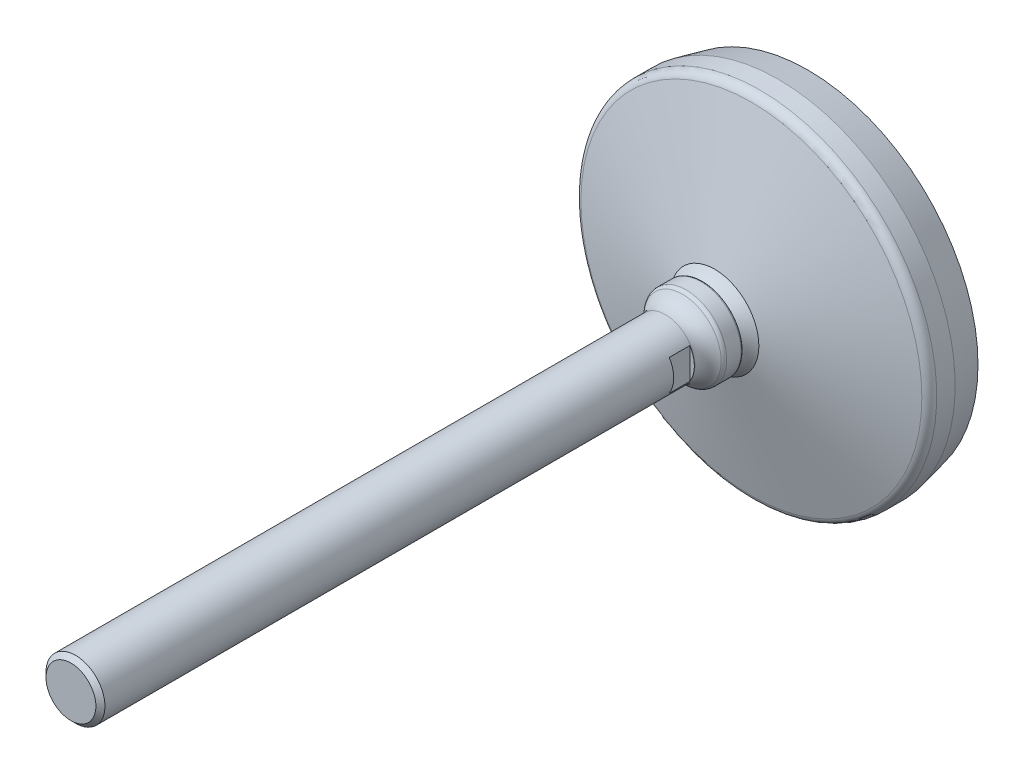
ISO-10303-21;
HEADER;
FILE_DESCRIPTION(('STEP AP214'),'2;1');
FILE_NAME('part.step','',(''),(''),'','','');
FILE_SCHEMA(('AUTOMOTIVE_DESIGN { 1 0 10303 214 1 1 1 1 }'));
ENDSEC;
DATA;
#1=APPLICATION_CONTEXT('core data for automotive mechanical design processes');
#2=APPLICATION_PROTOCOL_DEFINITION('international standard','automotive_design',2000,#1);
#3=PRODUCT_CONTEXT('',#1,'mechanical');
#4=PRODUCT('Part','Part','',(#3));
#5=PRODUCT_RELATED_PRODUCT_CATEGORY('part','',(#4));
#6=PRODUCT_DEFINITION_FORMATION('','',#4);
#7=PRODUCT_DEFINITION_CONTEXT('part definition',#1,'design');
#8=PRODUCT_DEFINITION('design','',#6,#7);
#9=PRODUCT_DEFINITION_SHAPE('','',#8);
#10=(LENGTH_UNIT() NAMED_UNIT(*) SI_UNIT(.MILLI.,.METRE.));
#11=(NAMED_UNIT(*) PLANE_ANGLE_UNIT() SI_UNIT($,.RADIAN.));
#12=(NAMED_UNIT(*) SI_UNIT($,.STERADIAN.) SOLID_ANGLE_UNIT());
#13=UNCERTAINTY_MEASURE_WITH_UNIT(LENGTH_MEASURE(1.E-05),#10,'distance_accuracy_value','');
#14=(GEOMETRIC_REPRESENTATION_CONTEXT(3) GLOBAL_UNCERTAINTY_ASSIGNED_CONTEXT((#13)) GLOBAL_UNIT_ASSIGNED_CONTEXT((#10,
#11,#12)) REPRESENTATION_CONTEXT('',''));
#15=CARTESIAN_POINT('',(0.,0.,0.));
#16=DIRECTION('',(0.,0.,1.));
#17=DIRECTION('',(1.,0.,0.));
#18=AXIS2_PLACEMENT_3D('',#15,#16,#17);
#19=CARTESIAN_POINT('',(0.,0.,40.6420167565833));
#20=DIRECTION('',(0.,0.,-1.));
#21=DIRECTION('',(0.,1.,0.));
#22=AXIS2_PLACEMENT_3D('',#19,#20,#21);
#23=TOROIDAL_SURFACE('',#22,22.8893556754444,12.);
#24=CARTESIAN_POINT('',(0.,0.,31.6));
#25=DIRECTION('',(0.,0.,-1.));
#26=DIRECTION('',(0.,1.,0.));
#27=AXIS2_PLACEMENT_3D('',#24,#25,#26);
#28=CIRCLE('',#27,15.);
#29=CARTESIAN_POINT('',(0.,15.,31.6));
#30=VERTEX_POINT('',#29);
#31=EDGE_CURVE('E86',#30,#30,#28,.T.);
#32=ORIENTED_EDGE('',*,*,#31,.F.);
#33=EDGE_LOOP('',(#32));
#34=FACE_BOUND('',#33,.T.);
#35=CARTESIAN_POINT('',(0.,0.,35.6));
#36=DIRECTION('',(0.,0.,-1.));
#37=DIRECTION('',(0.,1.,0.));
#38=AXIS2_PLACEMENT_3D('',#35,#36,#37);
#39=CIRCLE('',#38,12.);
#40=CARTESIAN_POINT('',(0.,12.,35.6));
#41=VERTEX_POINT('',#40);
#42=EDGE_CURVE('E61',#41,#41,#39,.T.);
#43=ORIENTED_EDGE('',*,*,#42,.T.);
#44=EDGE_LOOP('',(#43));
#45=FACE_BOUND('',#44,.T.);
#46=ADVANCED_FACE('F14',(#34,#45),#23,.F.);
#47=CARTESIAN_POINT('',(0.,0.,31.6));
#48=DIRECTION('',(0.,0.,-1.));
#49=DIRECTION('',(0.,1.,0.));
#50=AXIS2_PLACEMENT_3D('',#47,#48,#49);
#51=CONICAL_SURFACE('',#50,15.,1.2875142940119);
#52=CARTESIAN_POINT('',(0.,0.,19.1292293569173));
#53=DIRECTION('',(0.,0.,-1.));
#54=DIRECTION('',(0.,1.,0.));
#55=AXIS2_PLACEMENT_3D('',#52,#53,#54);
#56=CIRCLE('',#55,57.8385251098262);
#57=CARTESIAN_POINT('',(0.,57.8385251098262,19.1292293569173));
#58=VERTEX_POINT('',#57);
#59=EDGE_CURVE('E89',#58,#58,#56,.T.);
#60=CARTESIAN_POINT('',(0.,57.8385251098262,19.1292293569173));
#61=CARTESIAN_POINT('',(0.,57.3922904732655,19.2591332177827));
#62=CARTESIAN_POINT('',(0.,56.9460558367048,19.3890370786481));
#63=CARTESIAN_POINT('',(0.,56.0535865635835,19.648844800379));
#64=CARTESIAN_POINT('',(0.,55.6073519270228,19.7787486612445));
#65=CARTESIAN_POINT('',(0.,54.7148826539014,20.0385563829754));
#66=CARTESIAN_POINT('',(0.,54.2686480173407,20.1684602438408));
#67=CARTESIAN_POINT('',(0.,53.3761787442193,20.4282679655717));
#68=CARTESIAN_POINT('',(0.,52.9299441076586,20.5581718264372));
#69=CARTESIAN_POINT('',(0.,52.0374748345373,20.817979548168));
#70=CARTESIAN_POINT('',(0.,51.5912401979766,20.9478834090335));
#71=CARTESIAN_POINT('',(0.,50.6987709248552,21.2076911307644));
#72=CARTESIAN_POINT('',(0.,50.2525362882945,21.3375949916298));
#73=CARTESIAN_POINT('',(0.,49.3600670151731,21.5974027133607));
#74=CARTESIAN_POINT('',(0.,48.9138323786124,21.7273065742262));
#75=CARTESIAN_POINT('',(0.,48.021363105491,21.9871142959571));
#76=CARTESIAN_POINT('',(0.,47.5751284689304,22.1170181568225));
#77=CARTESIAN_POINT('',(0.,46.682659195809,22.3768258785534));
#78=CARTESIAN_POINT('',(0.,46.2364245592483,22.5067297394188));
#79=CARTESIAN_POINT('',(0.,45.3439552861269,22.7665374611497));
#80=CARTESIAN_POINT('',(0.,44.8977206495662,22.8964413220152));
#81=CARTESIAN_POINT('',(0.,44.0052513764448,23.1562490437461));
#82=CARTESIAN_POINT('',(0.,43.5590167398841,23.2861529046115));
#83=CARTESIAN_POINT('',(0.,42.6665474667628,23.5459606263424));
#84=CARTESIAN_POINT('',(0.,42.2203128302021,23.6758644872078));
#85=CARTESIAN_POINT('',(0.,41.3278435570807,23.9356722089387));
#86=CARTESIAN_POINT('',(0.,40.88160892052,24.0655760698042));
#87=CARTESIAN_POINT('',(0.,39.9891396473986,24.3253837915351));
#88=CARTESIAN_POINT('',(0.,39.5429050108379,24.4552876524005));
#89=CARTESIAN_POINT('',(0.,38.6504357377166,24.7150953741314));
#90=CARTESIAN_POINT('',(0.,38.2042011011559,24.8449992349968));
#91=CARTESIAN_POINT('',(0.,37.3117318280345,25.1048069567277));
#92=CARTESIAN_POINT('',(0.,36.8654971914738,25.2347108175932));
#93=CARTESIAN_POINT('',(0.,35.9730279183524,25.4945185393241));
#94=CARTESIAN_POINT('',(0.,35.5267932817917,25.6244224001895));
#95=CARTESIAN_POINT('',(0.,34.6343240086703,25.8842301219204));
#96=CARTESIAN_POINT('',(0.,34.1880893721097,26.0141339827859));
#97=CARTESIAN_POINT('',(0.,33.2956200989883,26.2739417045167));
#98=CARTESIAN_POINT('',(0.,32.8493854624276,26.4038455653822));
#99=CARTESIAN_POINT('',(0.,31.9569161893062,26.6636532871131));
#100=CARTESIAN_POINT('',(0.,31.5106815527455,26.7935571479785));
#101=CARTESIAN_POINT('',(0.,30.6182122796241,27.0533648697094));
#102=CARTESIAN_POINT('',(0.,30.1719776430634,27.1832687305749));
#103=CARTESIAN_POINT('',(0.,29.2795083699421,27.4430764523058));
#104=CARTESIAN_POINT('',(0.,28.8332737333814,27.5729803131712));
#105=CARTESIAN_POINT('',(0.,27.94080446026,27.8327880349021));
#106=CARTESIAN_POINT('',(0.,27.4945698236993,27.9626918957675));
#107=CARTESIAN_POINT('',(0.,26.6021005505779,28.2224996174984));
#108=CARTESIAN_POINT('',(0.,26.1558659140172,28.3524034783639));
#109=CARTESIAN_POINT('',(0.,25.2633966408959,28.6122112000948));
#110=CARTESIAN_POINT('',(0.,24.8171620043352,28.7421150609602));
#111=CARTESIAN_POINT('',(0.,23.9246927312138,29.0019227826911));
#112=CARTESIAN_POINT('',(0.,23.4784580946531,29.1318266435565));
#113=CARTESIAN_POINT('',(0.,22.5859888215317,29.3916343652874));
#114=CARTESIAN_POINT('',(0.,22.139754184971,29.5215382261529));
#115=CARTESIAN_POINT('',(0.,21.2472849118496,29.7813459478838));
#116=CARTESIAN_POINT('',(0.,20.801050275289,29.9112498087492));
#117=CARTESIAN_POINT('',(0.,19.9085810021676,30.1710575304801));
#118=CARTESIAN_POINT('',(0.,19.4623463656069,30.3009613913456));
#119=CARTESIAN_POINT('',(0.,18.5698770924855,30.5607691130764));
#120=CARTESIAN_POINT('',(0.,18.1236424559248,30.6906729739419));
#121=CARTESIAN_POINT('',(0.,17.2311731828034,30.9504806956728));
#122=CARTESIAN_POINT('',(0.,16.7849385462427,31.0803845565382));
#123=CARTESIAN_POINT('',(0.,15.8924692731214,31.3401922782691));
#124=CARTESIAN_POINT('',(0.,15.4462346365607,31.4700961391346));
#125=CARTESIAN_POINT('',(0.,15.,31.6));
#126=B_SPLINE_CURVE_WITH_KNOTS('',3,(#60,#61,#62,#63,#64,#65,#66,#67,#68,#69,#70,#71,#72,#73,
#74,#75,#76,#77,#78,#79,#80,#81,#82,#83,#84,#85,#86,#87,#88,#89,#90,#91,#92,#93,#94,#95,#96,#97,
#98,#99,#100,#101,#102,#103,#104,#105,#106,#107,#108,#109,#110,#111,#112,#113,#114,#115,#116,
#117,#118,#119,#120,#121,#122,#123,#124,#125),.UNSPECIFIED.,.F.,.F.,(4,2,2,2,2,2,2,2,2,2,2,2,2,
2,2,2,2,2,2,2,2,2,2,2,2,2,2,2,2,2,2,2,4),(0.,1.39427517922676,2.78855035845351,4.18282553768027,
5.57710071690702,6.97137589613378,8.36565107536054,9.75992625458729,11.154201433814,
12.5484766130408,13.9427517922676,15.3370269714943,16.7313021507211,18.1255773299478,
19.5198525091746,20.9141276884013,22.3084028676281,23.7026780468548,25.0969532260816,
26.4912284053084,27.8855035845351,29.2797787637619,30.6740539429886,32.0683291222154,
33.4626043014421,34.8568794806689,36.2511546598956,37.6454298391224,39.0397050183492,
40.4339801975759,41.8282553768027,43.2225305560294,44.6168057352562),.UNSPECIFIED.);
#127=EDGE_CURVE('BSEAM147',#58,#30,#126,.T.);
#128=ORIENTED_EDGE('',*,*,#59,.F.);
#129=ORIENTED_EDGE('',*,*,#31,.T.);
#130=ORIENTED_EDGE('',*,*,#127,.T.);
#131=ORIENTED_EDGE('',*,*,#127,.F.);
#132=EDGE_LOOP('',(#128,#130,#129,#131));
#133=FACE_BOUND('',#132,.T.);
#134=ADVANCED_FACE('F147',(#133),#51,.T.);
#135=CARTESIAN_POINT('',(0.,0.,16.2487995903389));
#136=DIRECTION('',(0.,0.,-1.));
#137=DIRECTION('',(0.,1.,0.));
#138=AXIS2_PLACEMENT_3D('',#135,#136,#137);
#139=TOROIDAL_SURFACE('',#138,57.,2.99999999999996);
#140=ORIENTED_EDGE('',*,*,#59,.T.);
#141=EDGE_LOOP('',(#140));
#142=FACE_BOUND('',#141,.T.);
#143=CARTESIAN_POINT('',(0.,0.,16.2487995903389));
#144=DIRECTION('',(0.,0.,-1.));
#145=DIRECTION('',(0.,1.,0.));
#146=AXIS2_PLACEMENT_3D('',#143,#144,#145);
#147=CIRCLE('',#146,60.);
#148=CARTESIAN_POINT('',(0.,60.,16.2487995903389));
#149=VERTEX_POINT('',#148);
#150=EDGE_CURVE('E92',#149,#149,#147,.T.);
#151=ORIENTED_EDGE('',*,*,#150,.F.);
#152=EDGE_LOOP('',(#151));
#153=FACE_BOUND('',#152,.T.);
#154=ADVANCED_FACE('F153',(#142,#153),#139,.T.);
#155=CARTESIAN_POINT('',(0.,0.,0.));
#156=DIRECTION('',(0.,0.,-1.));
#157=DIRECTION('',(0.,1.,0.));
#158=AXIS2_PLACEMENT_3D('',#155,#156,#157);
#159=CYLINDRICAL_SURFACE('',#158,60.);
#160=CARTESIAN_POINT('',(0.,0.,10.));
#161=DIRECTION('',(0.,0.,-1.));
#162=DIRECTION('',(0.,1.,0.));
#163=AXIS2_PLACEMENT_3D('',#160,#161,#162);
#164=CIRCLE('',#163,60.);
#165=CARTESIAN_POINT('',(0.,60.,10.));
#166=VERTEX_POINT('',#165);
#167=EDGE_CURVE('E95',#166,#166,#164,.T.);
#168=ORIENTED_EDGE('',*,*,#167,.F.);
#169=EDGE_LOOP('',(#168));
#170=FACE_BOUND('',#169,.T.);
#171=ORIENTED_EDGE('',*,*,#150,.T.);
#172=EDGE_LOOP('',(#171));
#173=FACE_BOUND('',#172,.T.);
#174=ADVANCED_FACE('F198',(#170,#173),#159,.T.);
#175=CARTESIAN_POINT('',(0.,0.,10.));
#176=DIRECTION('',(0.,0.,1.));
#177=DIRECTION('',(0.,-1.,0.));
#178=AXIS2_PLACEMENT_3D('',#175,#176,#177);
#179=CONICAL_SURFACE('',#178,60.,0.221314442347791);
#180=CARTESIAN_POINT('',(0.,0.,0.));
#181=DIRECTION('',(0.,0.,-1.));
#182=DIRECTION('',(0.,1.,0.));
#183=AXIS2_PLACEMENT_3D('',#180,#181,#182);
#184=CIRCLE('',#183,57.75);
#185=CARTESIAN_POINT('',(0.,57.75,0.));
#186=VERTEX_POINT('',#185);
#187=EDGE_CURVE('E98',#186,#186,#184,.T.);
#188=ORIENTED_EDGE('',*,*,#187,.F.);
#189=EDGE_LOOP('',(#188));
#190=FACE_BOUND('',#189,.T.);
#191=ORIENTED_EDGE('',*,*,#167,.T.);
#192=EDGE_LOOP('',(#191));
#193=FACE_BOUND('',#192,.T.);
#194=ADVANCED_FACE('F194',(#190,#193),#179,.T.);
#195=CARTESIAN_POINT('',(57.75,0.,0.));
#196=DIRECTION('',(0.,0.,1.));
#197=DIRECTION('',(0.,-1.,0.));
#198=AXIS2_PLACEMENT_3D('',#195,#196,#197);
#199=PLANE('',#198);
#200=ORIENTED_EDGE('',*,*,#187,.T.);
#201=EDGE_LOOP('',(#200));
#202=FACE_BOUND('',#201,.T.);
#203=ADVANCED_FACE('F187',(#202),#199,.F.);
#204=CARTESIAN_POINT('',(0.,0.,16.));
#205=DIRECTION('',(0.,0.,-1.));
#206=DIRECTION('',(0.,1.,0.));
#207=AXIS2_PLACEMENT_3D('',#204,#205,#206);
#208=CYLINDRICAL_SURFACE('',#207,10.);
#209=CARTESIAN_POINT('',(0.,0.,48.3));
#210=DIRECTION('',(0.,0.,-1.));
#211=DIRECTION('',(0.,1.,0.));
#212=AXIS2_PLACEMENT_3D('',#209,#210,#211);
#213=CIRCLE('',#212,10.);
#214=CARTESIAN_POINT('',(0.,10.,48.3));
#215=VERTEX_POINT('',#214);
#216=EDGE_CURVE('E107',#215,#215,#213,.T.);
#217=ORIENTED_EDGE('',*,*,#216,.F.);
#218=EDGE_LOOP('',(#217));
#219=FACE_BOUND('',#218,.T.);
#220=DIRECTION('',(0.,0.,-1.));
#221=VECTOR('',#220,1.);
#222=CARTESIAN_POINT('',(8.5,-5.26782687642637,16.));
#223=LINE('',#222,#221);
#224=CARTESIAN_POINT('',(8.5,-5.26782687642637,48.5));
#225=VERTEX_POINT('',#224);
#226=CARTESIAN_POINT('',(8.5,-5.26782687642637,55.5));
#227=VERTEX_POINT('',#226);
#228=EDGE_CURVE('E77',#225,#227,#223,.F.);
#229=ORIENTED_EDGE('',*,*,#228,.T.);
#230=CARTESIAN_POINT('',(0.,0.,55.5));
#231=DIRECTION('',(0.,0.,1.));
#232=DIRECTION('',(0.,-1.,0.));
#233=AXIS2_PLACEMENT_3D('',#230,#231,#232);
#234=CIRCLE('',#233,10.);
#235=CARTESIAN_POINT('',(8.5,5.26782687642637,55.5));
#236=VERTEX_POINT('',#235);
#237=EDGE_CURVE('E9',#227,#236,#234,.T.);
#238=ORIENTED_EDGE('',*,*,#237,.T.);
#239=DIRECTION('',(0.,0.,-1.));
#240=VECTOR('',#239,1.);
#241=CARTESIAN_POINT('',(8.5,5.26782687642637,16.));
#242=LINE('',#241,#240);
#243=CARTESIAN_POINT('',(8.5,5.26782687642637,48.5));
#244=VERTEX_POINT('',#243);
#245=EDGE_CURVE('E17',#236,#244,#242,.T.);
#246=ORIENTED_EDGE('',*,*,#245,.T.);
#247=CARTESIAN_POINT('',(0.,0.,48.5));
#248=DIRECTION('',(0.,0.,1.));
#249=DIRECTION('',(0.,-1.,0.));
#250=AXIS2_PLACEMENT_3D('',#247,#248,#249);
#251=CIRCLE('',#250,10.);
#252=EDGE_CURVE('E63',#225,#244,#251,.T.);
#253=ORIENTED_EDGE('',*,*,#252,.F.);
#254=EDGE_LOOP('',(#229,#238,#246,#253));
#255=FACE_BOUND('',#254,.T.);
#256=DIRECTION('',(0.,0.,-1.));
#257=VECTOR('',#256,1.);
#258=CARTESIAN_POINT('',(-8.5,5.26782687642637,16.));
#259=LINE('',#258,#257);
#260=CARTESIAN_POINT('',(-8.5,5.26782687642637,48.5));
#261=VERTEX_POINT('',#260);
#262=CARTESIAN_POINT('',(-8.5,5.26782687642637,55.5));
#263=VERTEX_POINT('',#262);
#264=EDGE_CURVE('E60',#261,#263,#259,.F.);
#265=ORIENTED_EDGE('',*,*,#264,.T.);
#266=CARTESIAN_POINT('',(-8.5,-5.26782687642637,55.5));
#267=VERTEX_POINT('',#266);
#268=EDGE_CURVE('E23',#263,#267,#234,.T.);
#269=ORIENTED_EDGE('',*,*,#268,.T.);
#270=DIRECTION('',(0.,0.,-1.));
#271=VECTOR('',#270,1.);
#272=CARTESIAN_POINT('',(-8.5,-5.26782687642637,16.));
#273=LINE('',#272,#271);
#274=CARTESIAN_POINT('',(-8.5,-5.26782687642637,48.5));
#275=VERTEX_POINT('',#274);
#276=EDGE_CURVE('E67',#267,#275,#273,.T.);
#277=ORIENTED_EDGE('',*,*,#276,.T.);
#278=EDGE_CURVE('E55',#261,#275,#251,.T.);
#279=ORIENTED_EDGE('',*,*,#278,.F.);
#280=EDGE_LOOP('',(#265,#269,#277,#279));
#281=FACE_BOUND('',#280,.T.);
#282=CARTESIAN_POINT('',(0.,0.,248.4665));
#283=DIRECTION('',(0.,0.,-1.));
#284=DIRECTION('',(0.,1.,0.));
#285=AXIS2_PLACEMENT_3D('',#282,#283,#284);
#286=CIRCLE('',#285,10.);
#287=CARTESIAN_POINT('',(0.,10.,248.4665));
#288=VERTEX_POINT('',#287);
#289=EDGE_CURVE('E104',#288,#288,#286,.T.);
#290=ORIENTED_EDGE('',*,*,#289,.T.);
#291=EDGE_LOOP('',(#290));
#292=FACE_BOUND('',#291,.T.);
#293=ADVANCED_FACE('F73',(#219,#255,#281,#292),#208,.T.);
#294=CARTESIAN_POINT('',(0.,0.,48.3));
#295=DIRECTION('',(0.,0.,-1.));
#296=DIRECTION('',(0.,1.,0.));
#297=AXIS2_PLACEMENT_3D('',#294,#295,#296);
#298=TOROIDAL_SURFACE('',#297,17.,7.);
#299=CARTESIAN_POINT('',(0.,0.,42.4949938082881));
#300=DIRECTION('',(0.,0.,-1.));
#301=DIRECTION('',(0.,1.,0.));
#302=AXIS2_PLACEMENT_3D('',#299,#300,#301);
#303=CIRCLE('',#302,13.0882352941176);
#304=CARTESIAN_POINT('',(0.,13.0882352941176,42.4949938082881));
#305=VERTEX_POINT('',#304);
#306=EDGE_CURVE('E110',#305,#305,#303,.T.);
#307=ORIENTED_EDGE('',*,*,#306,.F.);
#308=EDGE_LOOP('',(#307));
#309=FACE_BOUND('',#308,.T.);
#310=ORIENTED_EDGE('',*,*,#216,.T.);
#311=EDGE_LOOP('',(#310));
#312=FACE_BOUND('',#311,.T.);
#313=ADVANCED_FACE('F180',(#309,#312),#298,.F.);
#314=CARTESIAN_POINT('',(0.,0.,41.2510639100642));
#315=DIRECTION('',(0.,0.,-1.));
#316=DIRECTION('',(0.,1.,0.));
#317=AXIS2_PLACEMENT_3D('',#314,#315,#316);
#318=TOROIDAL_SURFACE('',#317,12.25,1.5);
#319=ORIENTED_EDGE('',*,*,#306,.T.);
#320=EDGE_LOOP('',(#319));
#321=FACE_BOUND('',#320,.T.);
#322=CARTESIAN_POINT('',(0.,0.,41.2510639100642));
#323=DIRECTION('',(0.,0.,-1.));
#324=DIRECTION('',(0.,1.,0.));
#325=AXIS2_PLACEMENT_3D('',#322,#323,#324);
#326=CIRCLE('',#325,13.75);
#327=CARTESIAN_POINT('',(0.,13.75,41.2510639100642));
#328=VERTEX_POINT('',#327);
#329=EDGE_CURVE('E113',#328,#328,#326,.T.);
#330=ORIENTED_EDGE('',*,*,#329,.F.);
#331=EDGE_LOOP('',(#330));
#332=FACE_BOUND('',#331,.T.);
#333=ADVANCED_FACE('F173',(#321,#332),#318,.T.);
#334=CARTESIAN_POINT('',(0.,0.,16.));
#335=DIRECTION('',(0.,0.,-1.));
#336=DIRECTION('',(0.,1.,0.));
#337=AXIS2_PLACEMENT_3D('',#334,#335,#336);
#338=CYLINDRICAL_SURFACE('',#337,13.75);
#339=CARTESIAN_POINT('',(0.,0.,36.35));
#340=DIRECTION('',(0.,0.,-1.));
#341=DIRECTION('',(0.,1.,0.));
#342=AXIS2_PLACEMENT_3D('',#339,#340,#341);
#343=CIRCLE('',#342,13.75);
#344=CARTESIAN_POINT('',(0.,13.75,36.35));
#345=VERTEX_POINT('',#344);
#346=EDGE_CURVE('E116',#345,#345,#343,.T.);
#347=ORIENTED_EDGE('',*,*,#346,.F.);
#348=EDGE_LOOP('',(#347));
#349=FACE_BOUND('',#348,.T.);
#350=ORIENTED_EDGE('',*,*,#329,.T.);
#351=EDGE_LOOP('',(#350));
#352=FACE_BOUND('',#351,.T.);
#353=ADVANCED_FACE('F166',(#349,#352),#338,.T.);
#354=CARTESIAN_POINT('',(0.,0.,36.35));
#355=DIRECTION('',(0.,0.,-1.));
#356=DIRECTION('',(0.,1.,0.));
#357=AXIS2_PLACEMENT_3D('',#354,#355,#356);
#358=TOROIDAL_SURFACE('',#357,13.,0.75);
#359=ORIENTED_EDGE('',*,*,#346,.T.);
#360=EDGE_LOOP('',(#359));
#361=FACE_BOUND('',#360,.T.);
#362=CARTESIAN_POINT('',(0.,0.,35.6));
#363=DIRECTION('',(0.,0.,-1.));
#364=DIRECTION('',(0.,1.,0.));
#365=AXIS2_PLACEMENT_3D('',#362,#363,#364);
#366=CIRCLE('',#365,13.);
#367=CARTESIAN_POINT('',(0.,13.,35.6));
#368=VERTEX_POINT('',#367);
#369=EDGE_CURVE('E119',#368,#368,#366,.T.);
#370=ORIENTED_EDGE('',*,*,#369,.F.);
#371=EDGE_LOOP('',(#370));
#372=FACE_BOUND('',#371,.T.);
#373=ADVANCED_FACE('F161',(#361,#372),#358,.T.);
#374=CARTESIAN_POINT('',(13.,0.,35.6));
#375=DIRECTION('',(0.,0.,1.));
#376=DIRECTION('',(0.,-1.,0.));
#377=AXIS2_PLACEMENT_3D('',#374,#375,#376);
#378=PLANE('',#377);
#379=ORIENTED_EDGE('',*,*,#42,.F.);
#380=EDGE_LOOP('',(#379));
#381=FACE_BOUND('',#380,.T.);
#382=ORIENTED_EDGE('',*,*,#369,.T.);
#383=EDGE_LOOP('',(#382));
#384=FACE_BOUND('',#383,.T.);
#385=ADVANCED_FACE('F145',(#381,#384),#378,.F.);
#386=CARTESIAN_POINT('',(0.,0.,48.5));
#387=DIRECTION('',(0.,0.,1.));
#388=DIRECTION('',(0.,-1.,0.));
#389=AXIS2_PLACEMENT_3D('',#386,#387,#388);
#390=PLANE('',#389);
#391=ORIENTED_EDGE('',*,*,#278,.T.);
#392=DIRECTION('',(0.,-1.,0.));
#393=VECTOR('',#392,1.);
#394=CARTESIAN_POINT('',(-8.5,20.,48.5));
#395=LINE('',#394,#393);
#396=EDGE_CURVE('E29',#261,#275,#395,.T.);
#397=ORIENTED_EDGE('',*,*,#396,.F.);
#398=EDGE_LOOP('',(#391,#397));
#399=FACE_BOUND('',#398,.T.);
#400=ADVANCED_FACE('F56',(#399),#390,.T.);
#401=CARTESIAN_POINT('',(0.,0.,55.5));
#402=DIRECTION('',(0.,0.,1.));
#403=DIRECTION('',(0.,-1.,0.));
#404=AXIS2_PLACEMENT_3D('',#401,#402,#403);
#405=PLANE('',#404);
#406=DIRECTION('',(0.,-1.,0.));
#407=VECTOR('',#406,1.);
#408=CARTESIAN_POINT('',(-8.5,20.,55.5));
#409=LINE('',#408,#407);
#410=EDGE_CURVE('E121',#263,#267,#409,.T.);
#411=ORIENTED_EDGE('',*,*,#410,.T.);
#412=ORIENTED_EDGE('',*,*,#268,.F.);
#413=EDGE_LOOP('',(#411,#412));
#414=FACE_BOUND('',#413,.T.);
#415=ADVANCED_FACE('F142',(#414),#405,.F.);
#416=CARTESIAN_POINT('',(-8.5,20.,55.5));
#417=DIRECTION('',(1.,0.,0.));
#418=DIRECTION('',(0.,1.,0.));
#419=AXIS2_PLACEMENT_3D('',#416,#417,#418);
#420=PLANE('',#419);
#421=ORIENTED_EDGE('',*,*,#410,.F.);
#422=ORIENTED_EDGE('',*,*,#264,.F.);
#423=ORIENTED_EDGE('',*,*,#396,.T.);
#424=ORIENTED_EDGE('',*,*,#276,.F.);
#425=EDGE_LOOP('',(#421,#422,#423,#424));
#426=FACE_BOUND('',#425,.T.);
#427=ADVANCED_FACE('F66',(#426),#420,.F.);
#428=CARTESIAN_POINT('',(8.5,-20.,55.5));
#429=DIRECTION('',(-1.,0.,0.));
#430=DIRECTION('',(0.,-1.,0.));
#431=AXIS2_PLACEMENT_3D('',#428,#429,#430);
#432=PLANE('',#431);
#433=DIRECTION('',(0.,1.,0.));
#434=VECTOR('',#433,1.);
#435=CARTESIAN_POINT('',(8.5,-20.,55.5));
#436=LINE('',#435,#434);
#437=EDGE_CURVE('E69',#227,#236,#436,.T.);
#438=ORIENTED_EDGE('',*,*,#437,.F.);
#439=ORIENTED_EDGE('',*,*,#228,.F.);
#440=DIRECTION('',(0.,1.,0.));
#441=VECTOR('',#440,1.);
#442=CARTESIAN_POINT('',(8.5,-20.,48.5));
#443=LINE('',#442,#441);
#444=EDGE_CURVE('E70',#225,#244,#443,.T.);
#445=ORIENTED_EDGE('',*,*,#444,.T.);
#446=ORIENTED_EDGE('',*,*,#245,.F.);
#447=EDGE_LOOP('',(#438,#439,#445,#446));
#448=FACE_BOUND('',#447,.T.);
#449=ADVANCED_FACE('F127',(#448),#432,.F.);
#450=ORIENTED_EDGE('',*,*,#437,.T.);
#451=ORIENTED_EDGE('',*,*,#237,.F.);
#452=EDGE_LOOP('',(#450,#451));
#453=FACE_BOUND('',#452,.T.);
#454=ADVANCED_FACE('F126',(#453),#405,.F.);
#455=ORIENTED_EDGE('',*,*,#444,.F.);
#456=ORIENTED_EDGE('',*,*,#252,.T.);
#457=EDGE_LOOP('',(#455,#456));
#458=FACE_BOUND('',#457,.T.);
#459=ADVANCED_FACE('F128',(#458),#390,.T.);
#460=CARTESIAN_POINT('',(0.,0.,250.));
#461=DIRECTION('',(0.,0.,-1.));
#462=DIRECTION('',(0.,1.,0.));
#463=AXIS2_PLACEMENT_3D('',#460,#461,#462);
#464=PLANE('',#463);
#465=CARTESIAN_POINT('',(0.,0.,250.));
#466=DIRECTION('',(0.,0.,-1.));
#467=DIRECTION('',(0.,1.,0.));
#468=AXIS2_PLACEMENT_3D('',#465,#466,#467);
#469=CIRCLE('',#468,8.4665);
#470=CARTESIAN_POINT('',(0.,8.4665,250.));
#471=VERTEX_POINT('',#470);
#472=EDGE_CURVE('E101',#471,#471,#469,.T.);
#473=ORIENTED_EDGE('',*,*,#472,.F.);
#474=EDGE_LOOP('',(#473));
#475=FACE_BOUND('',#474,.T.);
#476=ADVANCED_FACE('F130',(#475),#464,.F.);
#477=CARTESIAN_POINT('',(0.,0.,250.));
#478=DIRECTION('',(0.,0.,-1.));
#479=DIRECTION('',(0.,1.,0.));
#480=AXIS2_PLACEMENT_3D('',#477,#478,#479);
#481=CONICAL_SURFACE('',#480,8.4665,0.78539816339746);
#482=ORIENTED_EDGE('',*,*,#289,.F.);
#483=EDGE_LOOP('',(#482));
#484=FACE_BOUND('',#483,.T.);
#485=ORIENTED_EDGE('',*,*,#472,.T.);
#486=EDGE_LOOP('',(#485));
#487=FACE_BOUND('',#486,.T.);
#488=ADVANCED_FACE('F138',(#484,#487),#481,.T.);
#489=CLOSED_SHELL('',(#46,#134,#154,#174,#194,#203,#293,#313,#333,#353,#373,#385,#400,#415,#427,
#449,#454,#459,#476,#488));
#490=MANIFOLD_SOLID_BREP('B1',#489);
#491=ADVANCED_BREP_SHAPE_REPRESENTATION('',(#18,#490),#14);
#492=SHAPE_DEFINITION_REPRESENTATION(#9,#491);
ENDSEC;
END-ISO-10303-21;
